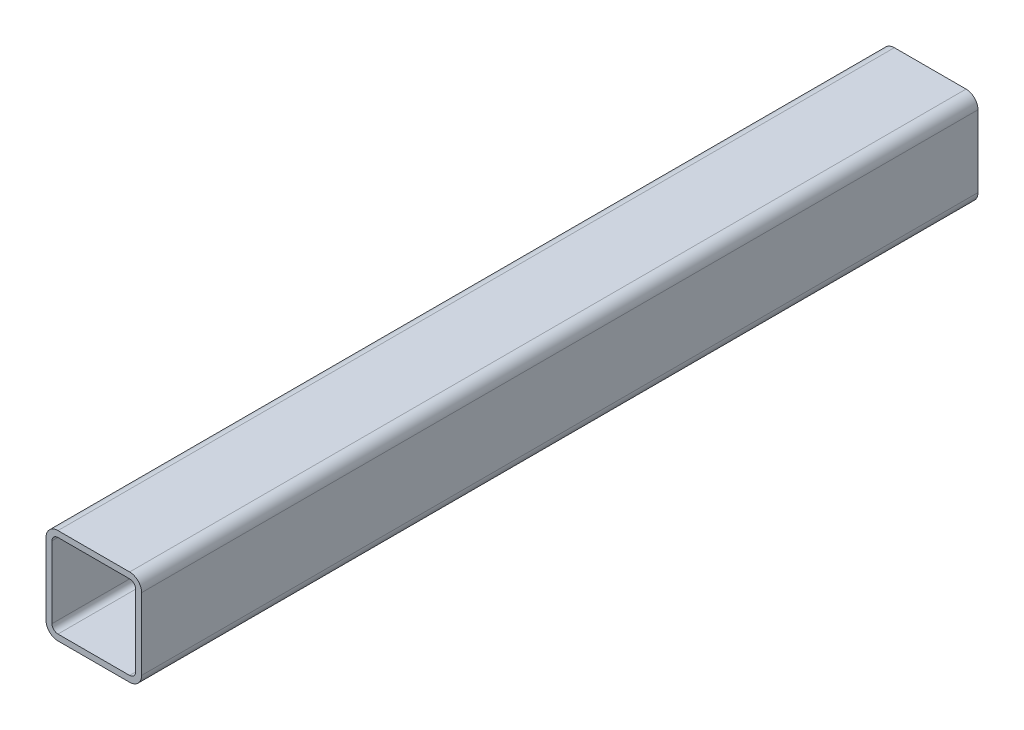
ISO-10303-21;
HEADER;
FILE_DESCRIPTION(('STEP AP214'),'2;1');
FILE_NAME('part.step','',(''),(''),'','','');
FILE_SCHEMA(('AUTOMOTIVE_DESIGN { 1 0 10303 214 1 1 1 1 }'));
ENDSEC;
DATA;
#1=APPLICATION_CONTEXT('core data for automotive mechanical design processes');
#2=APPLICATION_PROTOCOL_DEFINITION('international standard','automotive_design',2000,#1);
#3=PRODUCT_CONTEXT('',#1,'mechanical');
#4=PRODUCT('Part','Part','',(#3));
#5=PRODUCT_RELATED_PRODUCT_CATEGORY('part','',(#4));
#6=PRODUCT_DEFINITION_FORMATION('','',#4);
#7=PRODUCT_DEFINITION_CONTEXT('part definition',#1,'design');
#8=PRODUCT_DEFINITION('design','',#6,#7);
#9=PRODUCT_DEFINITION_SHAPE('','',#8);
#10=(LENGTH_UNIT() NAMED_UNIT(*) SI_UNIT(.MILLI.,.METRE.));
#11=(NAMED_UNIT(*) PLANE_ANGLE_UNIT() SI_UNIT($,.RADIAN.));
#12=(NAMED_UNIT(*) SI_UNIT($,.STERADIAN.) SOLID_ANGLE_UNIT());
#13=UNCERTAINTY_MEASURE_WITH_UNIT(LENGTH_MEASURE(1.E-05),#10,'distance_accuracy_value','');
#14=(GEOMETRIC_REPRESENTATION_CONTEXT(3) GLOBAL_UNCERTAINTY_ASSIGNED_CONTEXT((#13)) GLOBAL_UNIT_ASSIGNED_CONTEXT((#10,
#11,#12)) REPRESENTATION_CONTEXT('',''));
#15=CARTESIAN_POINT('',(0.,0.,0.));
#16=DIRECTION('',(0.,0.,1.));
#17=DIRECTION('',(1.,0.,0.));
#18=AXIS2_PLACEMENT_3D('',#15,#16,#17);
#19=CARTESIAN_POINT('',(-76.2,76.2,-1625.6));
#20=DIRECTION('',(0.,0.,1.));
#21=DIRECTION('',(1.,0.,0.));
#22=AXIS2_PLACEMENT_3D('',#19,#20,#21);
#23=CYLINDRICAL_SURFACE('',#22,25.4);
#24=DIRECTION('',(0.,0.,1.));
#25=VECTOR('',#24,1.);
#26=CARTESIAN_POINT('',(-101.6,76.2,-1625.6));
#27=LINE('',#26,#25);
#28=CARTESIAN_POINT('',(-101.6,76.2,-1625.6));
#29=VERTEX_POINT('',#28);
#30=CARTESIAN_POINT('',(-101.6,76.2,152.4));
#31=VERTEX_POINT('',#30);
#32=EDGE_CURVE('E48',#29,#31,#27,.T.);
#33=ORIENTED_EDGE('',*,*,#32,.T.);
#34=CARTESIAN_POINT('',(-76.2,76.2,152.4));
#35=DIRECTION('',(0.,0.,1.));
#36=DIRECTION('',(1.,0.,0.));
#37=AXIS2_PLACEMENT_3D('',#34,#35,#36);
#38=CIRCLE('',#37,25.4);
#39=CARTESIAN_POINT('',(-76.2,101.6,152.4));
#40=VERTEX_POINT('',#39);
#41=EDGE_CURVE('E211',#40,#31,#38,.T.);
#42=ORIENTED_EDGE('',*,*,#41,.F.);
#43=DIRECTION('',(0.,0.,1.));
#44=VECTOR('',#43,1.);
#45=CARTESIAN_POINT('',(-76.2,101.6,-1625.6));
#46=LINE('',#45,#44);
#47=CARTESIAN_POINT('',(-76.2,101.6,-1625.6));
#48=VERTEX_POINT('',#47);
#49=EDGE_CURVE('E11',#48,#40,#46,.T.);
#50=ORIENTED_EDGE('',*,*,#49,.F.);
#51=CARTESIAN_POINT('',(-76.2,76.2,-1625.6));
#52=DIRECTION('',(0.,0.,1.));
#53=DIRECTION('',(1.,0.,0.));
#54=AXIS2_PLACEMENT_3D('',#51,#52,#53);
#55=CIRCLE('',#54,25.4);
#56=EDGE_CURVE('E271',#48,#29,#55,.T.);
#57=ORIENTED_EDGE('',*,*,#56,.T.);
#58=EDGE_LOOP('',(#33,#42,#50,#57));
#59=FACE_BOUND('',#58,.T.);
#60=ADVANCED_FACE('F45',(#59),#23,.T.);
#61=CARTESIAN_POINT('',(-76.2,101.6,-1625.6));
#62=DIRECTION('',(0.,1.,0.));
#63=DIRECTION('',(0.,0.,1.));
#64=AXIS2_PLACEMENT_3D('',#61,#62,#63);
#65=PLANE('',#64);
#66=ORIENTED_EDGE('',*,*,#49,.T.);
#67=DIRECTION('',(-1.,0.,0.));
#68=VECTOR('',#67,1.);
#69=CARTESIAN_POINT('',(-76.2,101.6,152.4));
#70=LINE('',#69,#68);
#71=CARTESIAN_POINT('',(76.2,101.6,152.4));
#72=VERTEX_POINT('',#71);
#73=EDGE_CURVE('E239',#72,#40,#70,.T.);
#74=ORIENTED_EDGE('',*,*,#73,.F.);
#75=DIRECTION('',(0.,0.,1.));
#76=VECTOR('',#75,1.);
#77=CARTESIAN_POINT('',(76.2,101.6,-1625.6));
#78=LINE('',#77,#76);
#79=CARTESIAN_POINT('',(76.2,101.6,-1625.6));
#80=VERTEX_POINT('',#79);
#81=EDGE_CURVE('E54',#80,#72,#78,.T.);
#82=ORIENTED_EDGE('',*,*,#81,.F.);
#83=DIRECTION('',(-1.,0.,0.));
#84=VECTOR('',#83,1.);
#85=CARTESIAN_POINT('',(-76.2,101.6,-1625.6));
#86=LINE('',#85,#84);
#87=EDGE_CURVE('E315',#80,#48,#86,.T.);
#88=ORIENTED_EDGE('',*,*,#87,.T.);
#89=EDGE_LOOP('',(#66,#74,#82,#88));
#90=FACE_BOUND('',#89,.T.);
#91=ADVANCED_FACE('F344',(#90),#65,.T.);
#92=CARTESIAN_POINT('',(76.2,76.2,-1625.6));
#93=DIRECTION('',(0.,0.,1.));
#94=DIRECTION('',(1.,0.,0.));
#95=AXIS2_PLACEMENT_3D('',#92,#93,#94);
#96=CYLINDRICAL_SURFACE('',#95,25.4);
#97=ORIENTED_EDGE('',*,*,#81,.T.);
#98=CARTESIAN_POINT('',(76.2,76.2,152.4));
#99=DIRECTION('',(0.,0.,1.));
#100=DIRECTION('',(1.,0.,0.));
#101=AXIS2_PLACEMENT_3D('',#98,#99,#100);
#102=CIRCLE('',#101,25.4);
#103=CARTESIAN_POINT('',(101.6,76.2,152.4));
#104=VERTEX_POINT('',#103);
#105=EDGE_CURVE('E235',#104,#72,#102,.T.);
#106=ORIENTED_EDGE('',*,*,#105,.F.);
#107=DIRECTION('',(0.,0.,1.));
#108=VECTOR('',#107,1.);
#109=CARTESIAN_POINT('',(101.6,76.2,-1625.6));
#110=LINE('',#109,#108);
#111=CARTESIAN_POINT('',(101.6,76.2,-1625.6));
#112=VERTEX_POINT('',#111);
#113=EDGE_CURVE('E321',#112,#104,#110,.T.);
#114=ORIENTED_EDGE('',*,*,#113,.F.);
#115=CARTESIAN_POINT('',(76.2,76.2,-1625.6));
#116=DIRECTION('',(0.,0.,1.));
#117=DIRECTION('',(1.,0.,0.));
#118=AXIS2_PLACEMENT_3D('',#115,#116,#117);
#119=CIRCLE('',#118,25.4);
#120=EDGE_CURVE('E311',#112,#80,#119,.T.);
#121=ORIENTED_EDGE('',*,*,#120,.T.);
#122=EDGE_LOOP('',(#97,#106,#114,#121));
#123=FACE_BOUND('',#122,.T.);
#124=ADVANCED_FACE('F365',(#123),#96,.T.);
#125=CARTESIAN_POINT('',(101.6,-76.2,-1625.6));
#126=DIRECTION('',(1.,0.,0.));
#127=DIRECTION('',(0.,0.,-1.));
#128=AXIS2_PLACEMENT_3D('',#125,#126,#127);
#129=PLANE('',#128);
#130=ORIENTED_EDGE('',*,*,#113,.T.);
#131=DIRECTION('',(0.,1.,0.));
#132=VECTOR('',#131,1.);
#133=CARTESIAN_POINT('',(101.6,-76.2,152.4));
#134=LINE('',#133,#132);
#135=CARTESIAN_POINT('',(101.6,-76.2,152.4));
#136=VERTEX_POINT('',#135);
#137=EDGE_CURVE('E231',#136,#104,#134,.T.);
#138=ORIENTED_EDGE('',*,*,#137,.F.);
#139=DIRECTION('',(0.,0.,1.));
#140=VECTOR('',#139,1.);
#141=CARTESIAN_POINT('',(101.6,-76.2,-1625.6));
#142=LINE('',#141,#140);
#143=CARTESIAN_POINT('',(101.6,-76.2,-1625.6));
#144=VERTEX_POINT('',#143);
#145=EDGE_CURVE('E324',#144,#136,#142,.T.);
#146=ORIENTED_EDGE('',*,*,#145,.F.);
#147=DIRECTION('',(0.,1.,0.));
#148=VECTOR('',#147,1.);
#149=CARTESIAN_POINT('',(101.6,-76.2,-1625.6));
#150=LINE('',#149,#148);
#151=EDGE_CURVE('E307',#144,#112,#150,.T.);
#152=ORIENTED_EDGE('',*,*,#151,.T.);
#153=EDGE_LOOP('',(#130,#138,#146,#152));
#154=FACE_BOUND('',#153,.T.);
#155=ADVANCED_FACE('F362',(#154),#129,.T.);
#156=CARTESIAN_POINT('',(76.2,-76.2,-1625.6));
#157=DIRECTION('',(0.,0.,1.));
#158=DIRECTION('',(1.,0.,0.));
#159=AXIS2_PLACEMENT_3D('',#156,#157,#158);
#160=CYLINDRICAL_SURFACE('',#159,25.4);
#161=ORIENTED_EDGE('',*,*,#145,.T.);
#162=CARTESIAN_POINT('',(76.2,-76.2,152.4));
#163=DIRECTION('',(0.,0.,1.));
#164=DIRECTION('',(1.,0.,0.));
#165=AXIS2_PLACEMENT_3D('',#162,#163,#164);
#166=CIRCLE('',#165,25.4);
#167=CARTESIAN_POINT('',(76.2,-101.6,152.4));
#168=VERTEX_POINT('',#167);
#169=EDGE_CURVE('E227',#168,#136,#166,.T.);
#170=ORIENTED_EDGE('',*,*,#169,.F.);
#171=DIRECTION('',(0.,0.,1.));
#172=VECTOR('',#171,1.);
#173=CARTESIAN_POINT('',(76.2,-101.6,-1625.6));
#174=LINE('',#173,#172);
#175=CARTESIAN_POINT('',(76.2,-101.6,-1625.6));
#176=VERTEX_POINT('',#175);
#177=EDGE_CURVE('E327',#176,#168,#174,.T.);
#178=ORIENTED_EDGE('',*,*,#177,.F.);
#179=CARTESIAN_POINT('',(76.2,-76.2,-1625.6));
#180=DIRECTION('',(0.,0.,1.));
#181=DIRECTION('',(1.,0.,0.));
#182=AXIS2_PLACEMENT_3D('',#179,#180,#181);
#183=CIRCLE('',#182,25.4);
#184=EDGE_CURVE('E303',#176,#144,#183,.T.);
#185=ORIENTED_EDGE('',*,*,#184,.T.);
#186=EDGE_LOOP('',(#161,#170,#178,#185));
#187=FACE_BOUND('',#186,.T.);
#188=ADVANCED_FACE('F360',(#187),#160,.T.);
#189=CARTESIAN_POINT('',(76.2,-101.6,-1625.6));
#190=DIRECTION('',(0.,-1.,0.));
#191=DIRECTION('',(0.,0.,-1.));
#192=AXIS2_PLACEMENT_3D('',#189,#190,#191);
#193=PLANE('',#192);
#194=ORIENTED_EDGE('',*,*,#177,.T.);
#195=DIRECTION('',(1.,0.,0.));
#196=VECTOR('',#195,1.);
#197=CARTESIAN_POINT('',(76.2,-101.6,152.4));
#198=LINE('',#197,#196);
#199=CARTESIAN_POINT('',(-76.2,-101.6,152.4));
#200=VERTEX_POINT('',#199);
#201=EDGE_CURVE('E223',#200,#168,#198,.T.);
#202=ORIENTED_EDGE('',*,*,#201,.F.);
#203=DIRECTION('',(0.,0.,1.));
#204=VECTOR('',#203,1.);
#205=CARTESIAN_POINT('',(-76.2,-101.6,-1625.6));
#206=LINE('',#205,#204);
#207=CARTESIAN_POINT('',(-76.2,-101.6,-1625.6));
#208=VERTEX_POINT('',#207);
#209=EDGE_CURVE('E330',#208,#200,#206,.T.);
#210=ORIENTED_EDGE('',*,*,#209,.F.);
#211=DIRECTION('',(1.,0.,0.));
#212=VECTOR('',#211,1.);
#213=CARTESIAN_POINT('',(76.2,-101.6,-1625.6));
#214=LINE('',#213,#212);
#215=EDGE_CURVE('E299',#208,#176,#214,.T.);
#216=ORIENTED_EDGE('',*,*,#215,.T.);
#217=EDGE_LOOP('',(#194,#202,#210,#216));
#218=FACE_BOUND('',#217,.T.);
#219=ADVANCED_FACE('F358',(#218),#193,.T.);
#220=CARTESIAN_POINT('',(-76.2,-76.2,-1625.6));
#221=DIRECTION('',(0.,0.,1.));
#222=DIRECTION('',(1.,0.,0.));
#223=AXIS2_PLACEMENT_3D('',#220,#221,#222);
#224=CYLINDRICAL_SURFACE('',#223,25.4);
#225=ORIENTED_EDGE('',*,*,#209,.T.);
#226=CARTESIAN_POINT('',(-76.2,-76.2,152.4));
#227=DIRECTION('',(0.,0.,1.));
#228=DIRECTION('',(1.,0.,0.));
#229=AXIS2_PLACEMENT_3D('',#226,#227,#228);
#230=CIRCLE('',#229,25.4);
#231=CARTESIAN_POINT('',(-101.6,-76.2,152.4));
#232=VERTEX_POINT('',#231);
#233=EDGE_CURVE('E219',#232,#200,#230,.T.);
#234=ORIENTED_EDGE('',*,*,#233,.F.);
#235=DIRECTION('',(0.,0.,1.));
#236=VECTOR('',#235,1.);
#237=CARTESIAN_POINT('',(-101.6,-76.2,-1625.6));
#238=LINE('',#237,#236);
#239=CARTESIAN_POINT('',(-101.6,-76.2,-1625.6));
#240=VERTEX_POINT('',#239);
#241=EDGE_CURVE('E332',#240,#232,#238,.T.);
#242=ORIENTED_EDGE('',*,*,#241,.F.);
#243=CARTESIAN_POINT('',(-76.2,-76.2,-1625.6));
#244=DIRECTION('',(0.,0.,1.));
#245=DIRECTION('',(1.,0.,0.));
#246=AXIS2_PLACEMENT_3D('',#243,#244,#245);
#247=CIRCLE('',#246,25.4);
#248=EDGE_CURVE('E295',#240,#208,#247,.T.);
#249=ORIENTED_EDGE('',*,*,#248,.T.);
#250=EDGE_LOOP('',(#225,#234,#242,#249));
#251=FACE_BOUND('',#250,.T.);
#252=ADVANCED_FACE('F354',(#251),#224,.T.);
#253=CARTESIAN_POINT('',(-101.6,76.2,-1625.6));
#254=DIRECTION('',(-1.,0.,0.));
#255=DIRECTION('',(0.,-1.,0.));
#256=AXIS2_PLACEMENT_3D('',#253,#254,#255);
#257=PLANE('',#256);
#258=ORIENTED_EDGE('',*,*,#241,.T.);
#259=DIRECTION('',(0.,-1.,0.));
#260=VECTOR('',#259,1.);
#261=CARTESIAN_POINT('',(-101.6,76.2,152.4));
#262=LINE('',#261,#260);
#263=EDGE_CURVE('E215',#31,#232,#262,.T.);
#264=ORIENTED_EDGE('',*,*,#263,.F.);
#265=ORIENTED_EDGE('',*,*,#32,.F.);
#266=DIRECTION('',(0.,-1.,0.));
#267=VECTOR('',#266,1.);
#268=CARTESIAN_POINT('',(-101.6,76.2,-1625.6));
#269=LINE('',#268,#267);
#270=EDGE_CURVE('E291',#29,#240,#269,.T.);
#271=ORIENTED_EDGE('',*,*,#270,.T.);
#272=EDGE_LOOP('',(#258,#264,#265,#271));
#273=FACE_BOUND('',#272,.T.);
#274=ADVANCED_FACE('F338',(#273),#257,.T.);
#275=CARTESIAN_POINT('',(-76.2,76.2,-1625.6));
#276=DIRECTION('',(0.,0.,1.));
#277=DIRECTION('',(1.,0.,0.));
#278=AXIS2_PLACEMENT_3D('',#275,#276,#277);
#279=PLANE('',#278);
#280=DIRECTION('',(0.,-1.,0.));
#281=VECTOR('',#280,1.);
#282=CARTESIAN_POINT('',(-88.9000000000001,76.2,-1625.6));
#283=LINE('',#282,#281);
#284=CARTESIAN_POINT('',(-88.9000000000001,76.2,-1625.6));
#285=VERTEX_POINT('',#284);
#286=CARTESIAN_POINT('',(-88.9,-76.2,-1625.6));
#287=VERTEX_POINT('',#286);
#288=EDGE_CURVE('E172',#285,#287,#283,.T.);
#289=ORIENTED_EDGE('',*,*,#288,.T.);
#290=CARTESIAN_POINT('',(-76.2,-76.2,-1625.6));
#291=DIRECTION('',(0.,0.,1.));
#292=DIRECTION('',(1.,0.,0.));
#293=AXIS2_PLACEMENT_3D('',#290,#291,#292);
#294=CIRCLE('',#293,12.7);
#295=CARTESIAN_POINT('',(-76.2,-88.9,-1625.6));
#296=VERTEX_POINT('',#295);
#297=EDGE_CURVE('E243',#287,#296,#294,.T.);
#298=ORIENTED_EDGE('',*,*,#297,.T.);
#299=DIRECTION('',(1.,0.,0.));
#300=VECTOR('',#299,1.);
#301=CARTESIAN_POINT('',(76.2,-88.9,-1625.6));
#302=LINE('',#301,#300);
#303=CARTESIAN_POINT('',(76.2,-88.9,-1625.6));
#304=VERTEX_POINT('',#303);
#305=EDGE_CURVE('E166',#296,#304,#302,.T.);
#306=ORIENTED_EDGE('',*,*,#305,.T.);
#307=CARTESIAN_POINT('',(76.2,-76.2,-1625.6));
#308=DIRECTION('',(0.,0.,1.));
#309=DIRECTION('',(1.,0.,0.));
#310=AXIS2_PLACEMENT_3D('',#307,#308,#309);
#311=CIRCLE('',#310,12.7);
#312=CARTESIAN_POINT('',(88.9,-76.2,-1625.6));
#313=VERTEX_POINT('',#312);
#314=EDGE_CURVE('E62',#304,#313,#311,.T.);
#315=ORIENTED_EDGE('',*,*,#314,.T.);
#316=DIRECTION('',(0.,1.,0.));
#317=VECTOR('',#316,1.);
#318=CARTESIAN_POINT('',(88.9,-76.2,-1625.6));
#319=LINE('',#318,#317);
#320=CARTESIAN_POINT('',(88.9,76.2,-1625.6));
#321=VERTEX_POINT('',#320);
#322=EDGE_CURVE('E250',#313,#321,#319,.T.);
#323=ORIENTED_EDGE('',*,*,#322,.T.);
#324=CARTESIAN_POINT('',(76.2,76.2,-1625.6));
#325=DIRECTION('',(0.,0.,1.));
#326=DIRECTION('',(1.,0.,0.));
#327=AXIS2_PLACEMENT_3D('',#324,#325,#326);
#328=CIRCLE('',#327,12.7);
#329=CARTESIAN_POINT('',(76.2,88.9,-1625.6));
#330=VERTEX_POINT('',#329);
#331=EDGE_CURVE('E254',#321,#330,#328,.T.);
#332=ORIENTED_EDGE('',*,*,#331,.T.);
#333=DIRECTION('',(-1.,0.,0.));
#334=VECTOR('',#333,1.);
#335=CARTESIAN_POINT('',(-76.2,88.9,-1625.6));
#336=LINE('',#335,#334);
#337=CARTESIAN_POINT('',(-76.2,88.9,-1625.6));
#338=VERTEX_POINT('',#337);
#339=EDGE_CURVE('E258',#330,#338,#336,.T.);
#340=ORIENTED_EDGE('',*,*,#339,.T.);
#341=CARTESIAN_POINT('',(-76.2,76.2,-1625.6));
#342=DIRECTION('',(0.,0.,1.));
#343=DIRECTION('',(1.,0.,0.));
#344=AXIS2_PLACEMENT_3D('',#341,#342,#343);
#345=CIRCLE('',#344,12.7);
#346=EDGE_CURVE('E262',#338,#285,#345,.T.);
#347=ORIENTED_EDGE('',*,*,#346,.T.);
#348=EDGE_LOOP('',(#289,#298,#306,#315,#323,#332,#340,#347));
#349=FACE_BOUND('',#348,.T.);
#350=ORIENTED_EDGE('',*,*,#56,.F.);
#351=ORIENTED_EDGE('',*,*,#87,.F.);
#352=ORIENTED_EDGE('',*,*,#120,.F.);
#353=ORIENTED_EDGE('',*,*,#151,.F.);
#354=ORIENTED_EDGE('',*,*,#184,.F.);
#355=ORIENTED_EDGE('',*,*,#215,.F.);
#356=ORIENTED_EDGE('',*,*,#248,.F.);
#357=ORIENTED_EDGE('',*,*,#270,.F.);
#358=EDGE_LOOP('',(#350,#351,#352,#353,#354,#355,#356,#357));
#359=FACE_BOUND('',#358,.T.);
#360=ADVANCED_FACE('F348',(#349,#359),#279,.F.);
#361=CARTESIAN_POINT('',(-76.2,-76.2,-1625.6));
#362=DIRECTION('',(0.,0.,1.));
#363=DIRECTION('',(1.,0.,0.));
#364=AXIS2_PLACEMENT_3D('',#361,#362,#363);
#365=CYLINDRICAL_SURFACE('',#364,12.7);
#366=DIRECTION('',(0.,0.,1.));
#367=VECTOR('',#366,1.);
#368=CARTESIAN_POINT('',(-88.9,-76.2,-1625.6));
#369=LINE('',#368,#367);
#370=CARTESIAN_POINT('',(-88.9,-76.2,152.4));
#371=VERTEX_POINT('',#370);
#372=EDGE_CURVE('E177',#287,#371,#369,.T.);
#373=ORIENTED_EDGE('',*,*,#372,.T.);
#374=CARTESIAN_POINT('',(-76.2,-76.2,152.4));
#375=DIRECTION('',(0.,0.,1.));
#376=DIRECTION('',(1.,0.,0.));
#377=AXIS2_PLACEMENT_3D('',#374,#375,#376);
#378=CIRCLE('',#377,12.7);
#379=CARTESIAN_POINT('',(-76.2,-88.9,152.4));
#380=VERTEX_POINT('',#379);
#381=EDGE_CURVE('E175',#371,#380,#378,.T.);
#382=ORIENTED_EDGE('',*,*,#381,.T.);
#383=DIRECTION('',(0.,0.,1.));
#384=VECTOR('',#383,1.);
#385=CARTESIAN_POINT('',(-76.2,-88.9,-1625.6));
#386=LINE('',#385,#384);
#387=EDGE_CURVE('E159',#296,#380,#386,.T.);
#388=ORIENTED_EDGE('',*,*,#387,.F.);
#389=ORIENTED_EDGE('',*,*,#297,.F.);
#390=EDGE_LOOP('',(#373,#382,#388,#389));
#391=FACE_BOUND('',#390,.T.);
#392=ADVANCED_FACE('F176',(#391),#365,.F.);
#393=CARTESIAN_POINT('',(-88.9000000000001,76.2,-1625.6));
#394=DIRECTION('',(-1.,0.,0.));
#395=DIRECTION('',(0.,-1.,0.));
#396=AXIS2_PLACEMENT_3D('',#393,#394,#395);
#397=PLANE('',#396);
#398=DIRECTION('',(0.,0.,1.));
#399=VECTOR('',#398,1.);
#400=CARTESIAN_POINT('',(-88.9000000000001,76.2,-1625.6));
#401=LINE('',#400,#399);
#402=CARTESIAN_POINT('',(-88.9000000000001,76.2,152.4));
#403=VERTEX_POINT('',#402);
#404=EDGE_CURVE('E272',#285,#403,#401,.T.);
#405=ORIENTED_EDGE('',*,*,#404,.T.);
#406=DIRECTION('',(0.,-1.,0.));
#407=VECTOR('',#406,1.);
#408=CARTESIAN_POINT('',(-88.9000000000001,76.2,152.4));
#409=LINE('',#408,#407);
#410=EDGE_CURVE('E208',#403,#371,#409,.T.);
#411=ORIENTED_EDGE('',*,*,#410,.T.);
#412=ORIENTED_EDGE('',*,*,#372,.F.);
#413=ORIENTED_EDGE('',*,*,#288,.F.);
#414=EDGE_LOOP('',(#405,#411,#412,#413));
#415=FACE_BOUND('',#414,.T.);
#416=ADVANCED_FACE('F442',(#415),#397,.F.);
#417=CARTESIAN_POINT('',(-76.2,76.2,-1625.6));
#418=DIRECTION('',(0.,0.,1.));
#419=DIRECTION('',(1.,0.,0.));
#420=AXIS2_PLACEMENT_3D('',#417,#418,#419);
#421=CYLINDRICAL_SURFACE('',#420,12.7);
#422=DIRECTION('',(0.,0.,1.));
#423=VECTOR('',#422,1.);
#424=CARTESIAN_POINT('',(-76.2,88.9,-1625.6));
#425=LINE('',#424,#423);
#426=CARTESIAN_POINT('',(-76.2,88.9,152.4));
#427=VERTEX_POINT('',#426);
#428=EDGE_CURVE('E275',#338,#427,#425,.T.);
#429=ORIENTED_EDGE('',*,*,#428,.T.);
#430=CARTESIAN_POINT('',(-76.2,76.2,152.4));
#431=DIRECTION('',(0.,0.,1.));
#432=DIRECTION('',(1.,0.,0.));
#433=AXIS2_PLACEMENT_3D('',#430,#431,#432);
#434=CIRCLE('',#433,12.7);
#435=EDGE_CURVE('E204',#427,#403,#434,.T.);
#436=ORIENTED_EDGE('',*,*,#435,.T.);
#437=ORIENTED_EDGE('',*,*,#404,.F.);
#438=ORIENTED_EDGE('',*,*,#346,.F.);
#439=EDGE_LOOP('',(#429,#436,#437,#438));
#440=FACE_BOUND('',#439,.T.);
#441=ADVANCED_FACE('F451',(#440),#421,.F.);
#442=CARTESIAN_POINT('',(-76.2,88.9,-1625.6));
#443=DIRECTION('',(0.,1.,0.));
#444=DIRECTION('',(0.,0.,1.));
#445=AXIS2_PLACEMENT_3D('',#442,#443,#444);
#446=PLANE('',#445);
#447=DIRECTION('',(0.,0.,1.));
#448=VECTOR('',#447,1.);
#449=CARTESIAN_POINT('',(76.2,88.9,-1625.6));
#450=LINE('',#449,#448);
#451=CARTESIAN_POINT('',(76.2,88.9,152.4));
#452=VERTEX_POINT('',#451);
#453=EDGE_CURVE('E278',#330,#452,#450,.T.);
#454=ORIENTED_EDGE('',*,*,#453,.T.);
#455=DIRECTION('',(-1.,0.,0.));
#456=VECTOR('',#455,1.);
#457=CARTESIAN_POINT('',(-76.2,88.9,152.4));
#458=LINE('',#457,#456);
#459=EDGE_CURVE('E200',#452,#427,#458,.T.);
#460=ORIENTED_EDGE('',*,*,#459,.T.);
#461=ORIENTED_EDGE('',*,*,#428,.F.);
#462=ORIENTED_EDGE('',*,*,#339,.F.);
#463=EDGE_LOOP('',(#454,#460,#461,#462));
#464=FACE_BOUND('',#463,.T.);
#465=ADVANCED_FACE('F461',(#464),#446,.F.);
#466=CARTESIAN_POINT('',(76.2,76.2,-1625.6));
#467=DIRECTION('',(0.,0.,1.));
#468=DIRECTION('',(1.,0.,0.));
#469=AXIS2_PLACEMENT_3D('',#466,#467,#468);
#470=CYLINDRICAL_SURFACE('',#469,12.7);
#471=DIRECTION('',(0.,0.,1.));
#472=VECTOR('',#471,1.);
#473=CARTESIAN_POINT('',(88.9,76.2,-1625.6));
#474=LINE('',#473,#472);
#475=CARTESIAN_POINT('',(88.9,76.2,152.4));
#476=VERTEX_POINT('',#475);
#477=EDGE_CURVE('E281',#321,#476,#474,.T.);
#478=ORIENTED_EDGE('',*,*,#477,.T.);
#479=CARTESIAN_POINT('',(76.2,76.2,152.4));
#480=DIRECTION('',(0.,0.,1.));
#481=DIRECTION('',(1.,0.,0.));
#482=AXIS2_PLACEMENT_3D('',#479,#480,#481);
#483=CIRCLE('',#482,12.7);
#484=EDGE_CURVE('E196',#476,#452,#483,.T.);
#485=ORIENTED_EDGE('',*,*,#484,.T.);
#486=ORIENTED_EDGE('',*,*,#453,.F.);
#487=ORIENTED_EDGE('',*,*,#331,.F.);
#488=EDGE_LOOP('',(#478,#485,#486,#487));
#489=FACE_BOUND('',#488,.T.);
#490=ADVANCED_FACE('F471',(#489),#470,.F.);
#491=CARTESIAN_POINT('',(88.9,-76.2,-1625.6));
#492=DIRECTION('',(1.,0.,0.));
#493=DIRECTION('',(0.,0.,-1.));
#494=AXIS2_PLACEMENT_3D('',#491,#492,#493);
#495=PLANE('',#494);
#496=DIRECTION('',(0.,0.,1.));
#497=VECTOR('',#496,1.);
#498=CARTESIAN_POINT('',(88.9,-76.2,-1625.6));
#499=LINE('',#498,#497);
#500=CARTESIAN_POINT('',(88.9,-76.2,152.4));
#501=VERTEX_POINT('',#500);
#502=EDGE_CURVE('E284',#313,#501,#499,.T.);
#503=ORIENTED_EDGE('',*,*,#502,.T.);
#504=DIRECTION('',(0.,1.,0.));
#505=VECTOR('',#504,1.);
#506=CARTESIAN_POINT('',(88.9,-76.2,152.4));
#507=LINE('',#506,#505);
#508=EDGE_CURVE('E190',#501,#476,#507,.T.);
#509=ORIENTED_EDGE('',*,*,#508,.T.);
#510=ORIENTED_EDGE('',*,*,#477,.F.);
#511=ORIENTED_EDGE('',*,*,#322,.F.);
#512=EDGE_LOOP('',(#503,#509,#510,#511));
#513=FACE_BOUND('',#512,.T.);
#514=ADVANCED_FACE('F481',(#513),#495,.F.);
#515=CARTESIAN_POINT('',(76.2,-76.2,-1625.6));
#516=DIRECTION('',(0.,0.,1.));
#517=DIRECTION('',(1.,0.,0.));
#518=AXIS2_PLACEMENT_3D('',#515,#516,#517);
#519=CYLINDRICAL_SURFACE('',#518,12.7);
#520=DIRECTION('',(0.,0.,1.));
#521=VECTOR('',#520,1.);
#522=CARTESIAN_POINT('',(76.2,-88.9,-1625.6));
#523=LINE('',#522,#521);
#524=CARTESIAN_POINT('',(76.2,-88.9,152.4));
#525=VERTEX_POINT('',#524);
#526=EDGE_CURVE('E171',#304,#525,#523,.T.);
#527=ORIENTED_EDGE('',*,*,#526,.T.);
#528=CARTESIAN_POINT('',(76.2,-76.2,152.4));
#529=DIRECTION('',(0.,0.,1.));
#530=DIRECTION('',(1.,0.,0.));
#531=AXIS2_PLACEMENT_3D('',#528,#529,#530);
#532=CIRCLE('',#531,12.7);
#533=EDGE_CURVE('E186',#525,#501,#532,.T.);
#534=ORIENTED_EDGE('',*,*,#533,.T.);
#535=ORIENTED_EDGE('',*,*,#502,.F.);
#536=ORIENTED_EDGE('',*,*,#314,.F.);
#537=EDGE_LOOP('',(#527,#534,#535,#536));
#538=FACE_BOUND('',#537,.T.);
#539=ADVANCED_FACE('F491',(#538),#519,.F.);
#540=CARTESIAN_POINT('',(76.2,-88.9,-1625.6));
#541=DIRECTION('',(0.,-1.,0.));
#542=DIRECTION('',(0.,0.,-1.));
#543=AXIS2_PLACEMENT_3D('',#540,#541,#542);
#544=PLANE('',#543);
#545=ORIENTED_EDGE('',*,*,#387,.T.);
#546=DIRECTION('',(1.,0.,0.));
#547=VECTOR('',#546,1.);
#548=CARTESIAN_POINT('',(76.2,-88.9,152.4));
#549=LINE('',#548,#547);
#550=EDGE_CURVE('E163',#380,#525,#549,.T.);
#551=ORIENTED_EDGE('',*,*,#550,.T.);
#552=ORIENTED_EDGE('',*,*,#526,.F.);
#553=ORIENTED_EDGE('',*,*,#305,.F.);
#554=EDGE_LOOP('',(#545,#551,#552,#553));
#555=FACE_BOUND('',#554,.T.);
#556=ADVANCED_FACE('F161',(#555),#544,.F.);
#557=CARTESIAN_POINT('',(-76.2,76.2,152.4));
#558=DIRECTION('',(0.,0.,1.));
#559=DIRECTION('',(1.,0.,0.));
#560=AXIS2_PLACEMENT_3D('',#557,#558,#559);
#561=PLANE('',#560);
#562=ORIENTED_EDGE('',*,*,#41,.T.);
#563=ORIENTED_EDGE('',*,*,#263,.T.);
#564=ORIENTED_EDGE('',*,*,#233,.T.);
#565=ORIENTED_EDGE('',*,*,#201,.T.);
#566=ORIENTED_EDGE('',*,*,#169,.T.);
#567=ORIENTED_EDGE('',*,*,#137,.T.);
#568=ORIENTED_EDGE('',*,*,#105,.T.);
#569=ORIENTED_EDGE('',*,*,#73,.T.);
#570=EDGE_LOOP('',(#562,#563,#564,#565,#566,#567,#568,#569));
#571=FACE_BOUND('',#570,.T.);
#572=ORIENTED_EDGE('',*,*,#550,.F.);
#573=ORIENTED_EDGE('',*,*,#381,.F.);
#574=ORIENTED_EDGE('',*,*,#410,.F.);
#575=ORIENTED_EDGE('',*,*,#435,.F.);
#576=ORIENTED_EDGE('',*,*,#459,.F.);
#577=ORIENTED_EDGE('',*,*,#484,.F.);
#578=ORIENTED_EDGE('',*,*,#508,.F.);
#579=ORIENTED_EDGE('',*,*,#533,.F.);
#580=EDGE_LOOP('',(#572,#573,#574,#575,#576,#577,#578,#579));
#581=FACE_BOUND('',#580,.T.);
#582=ADVANCED_FACE('F183',(#571,#581),#561,.T.);
#583=CLOSED_SHELL('',(#60,#91,#124,#155,#188,#219,#252,#274,#360,#392,#416,#441,#465,#490,#514,
#539,#556,#582));
#584=MANIFOLD_SOLID_BREP('B2',#583);
#585=ADVANCED_BREP_SHAPE_REPRESENTATION('',(#18,#584),#14);
#586=SHAPE_DEFINITION_REPRESENTATION(#9,#585);
ENDSEC;
END-ISO-10303-21;
